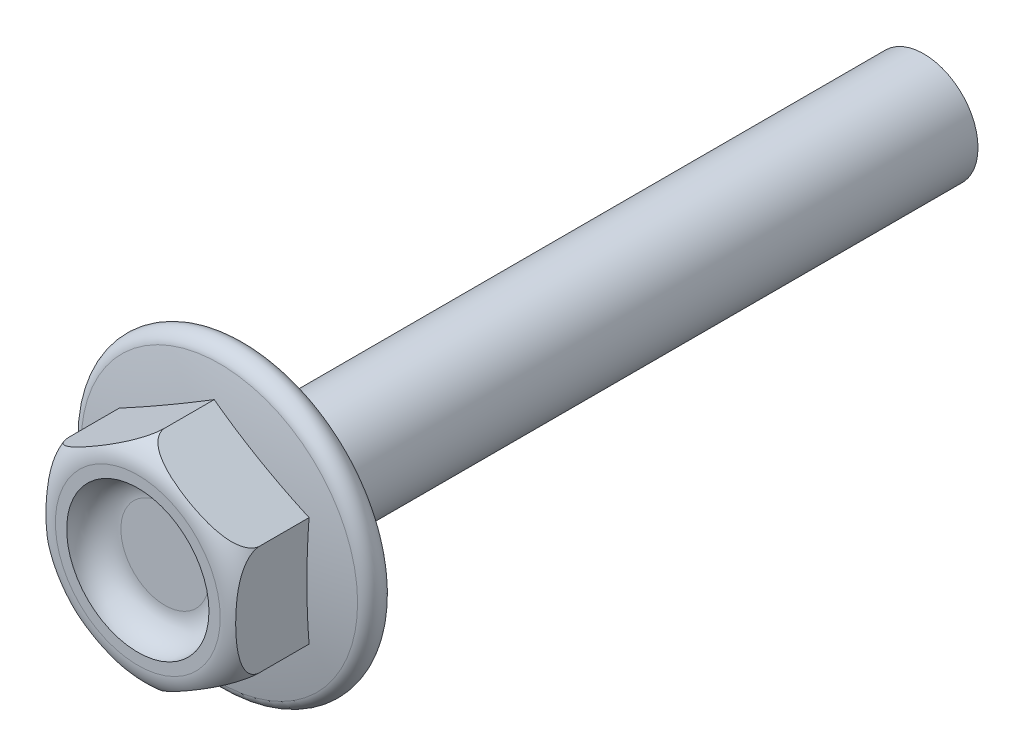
ISO-10303-21;
HEADER;
FILE_DESCRIPTION(('STEP AP214'),'2;1');
FILE_NAME('part.step','',(''),(''),'','','');
FILE_SCHEMA(('AUTOMOTIVE_DESIGN { 1 0 10303 214 1 1 1 1 }'));
ENDSEC;
DATA;
#1=APPLICATION_CONTEXT('core data for automotive mechanical design processes');
#2=APPLICATION_PROTOCOL_DEFINITION('international standard','automotive_design',2000,#1);
#3=PRODUCT_CONTEXT('',#1,'mechanical');
#4=PRODUCT('Part','Part','',(#3));
#5=PRODUCT_RELATED_PRODUCT_CATEGORY('part','',(#4));
#6=PRODUCT_DEFINITION_FORMATION('','',#4);
#7=PRODUCT_DEFINITION_CONTEXT('part definition',#1,'design');
#8=PRODUCT_DEFINITION('design','',#6,#7);
#9=PRODUCT_DEFINITION_SHAPE('','',#8);
#10=(LENGTH_UNIT() NAMED_UNIT(*) SI_UNIT(.MILLI.,.METRE.));
#11=(NAMED_UNIT(*) PLANE_ANGLE_UNIT() SI_UNIT($,.RADIAN.));
#12=(NAMED_UNIT(*) SI_UNIT($,.STERADIAN.) SOLID_ANGLE_UNIT());
#13=UNCERTAINTY_MEASURE_WITH_UNIT(LENGTH_MEASURE(1.E-05),#10,'distance_accuracy_value','');
#14=(GEOMETRIC_REPRESENTATION_CONTEXT(3) GLOBAL_UNCERTAINTY_ASSIGNED_CONTEXT((#13)) GLOBAL_UNIT_ASSIGNED_CONTEXT((#10,
#11,#12)) REPRESENTATION_CONTEXT('',''));
#15=CARTESIAN_POINT('',(0.,0.,0.));
#16=DIRECTION('',(0.,0.,1.));
#17=DIRECTION('',(1.,0.,0.));
#18=AXIS2_PLACEMENT_3D('',#15,#16,#17);
#19=CARTESIAN_POINT('',(0.,4.04145188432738,4.));
#20=DIRECTION('',(0.500000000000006,0.866025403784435,0.));
#21=DIRECTION('',(-0.866025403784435,0.500000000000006,0.));
#22=AXIS2_PLACEMENT_3D('',#19,#20,#21);
#23=PLANE('',#22);
#24=DIRECTION('',(0.,0.,-1.));
#25=VECTOR('',#24,1.);
#26=CARTESIAN_POINT('',(0.,4.04145188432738,4.));
#27=LINE('',#26,#25);
#28=CARTESIAN_POINT('',(0.,4.04145188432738,3.));
#29=VERTEX_POINT('',#28);
#30=CARTESIAN_POINT('',(0.,4.04145188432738,1.18087034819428));
#31=VERTEX_POINT('',#30);
#32=EDGE_CURVE('E51',#29,#31,#27,.T.);
#33=ORIENTED_EDGE('',*,*,#32,.F.);
#34=CARTESIAN_POINT('',(3.46410156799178E-08,4.04145186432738,2.9998));
#35=CARTESIAN_POINT('',(-6.54132162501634E-05,4.04148965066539,3.02946004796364));
#36=CARTESIAN_POINT('',(0.00226144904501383,4.04014623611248,3.05905658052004));
#37=CARTESIAN_POINT('',(0.0112266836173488,4.03497015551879,3.11713737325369));
#38=CARTESIAN_POINT('',(0.0178312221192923,4.03115702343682,3.14562851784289));
#39=CARTESIAN_POINT('',(0.0348712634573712,4.02131895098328,3.20093447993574));
#40=CARTESIAN_POINT('',(0.0452976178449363,4.01529929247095,3.22775312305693));
#41=CARTESIAN_POINT('',(0.0693600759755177,4.0014068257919,3.27943202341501));
#42=CARTESIAN_POINT('',(0.0830027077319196,3.99353024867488,3.30428815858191));
#43=CARTESIAN_POINT('',(0.121428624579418,3.97134503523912,3.36543474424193));
#44=CARTESIAN_POINT('',(0.148119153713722,3.95593525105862,3.40012716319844));
#45=CARTESIAN_POINT('',(0.205872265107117,3.9225914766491,3.46423943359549));
#46=CARTESIAN_POINT('',(0.23694539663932,3.90465139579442,3.49364616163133));
#47=CARTESIAN_POINT('',(0.323036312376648,3.85494678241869,3.5651961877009));
#48=CARTESIAN_POINT('',(0.380554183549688,3.82173882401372,3.60329409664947));
#49=CARTESIAN_POINT('',(0.499668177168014,3.75296832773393,3.66943708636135));
#50=CARTESIAN_POINT('',(0.561272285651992,3.71740117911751,3.69746175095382));
#51=CARTESIAN_POINT('',(0.70657163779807,3.6335125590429,3.75351666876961));
#52=CARTESIAN_POINT('',(0.791067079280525,3.5847290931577,3.77871981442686));
#53=CARTESIAN_POINT('',(0.961803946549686,3.48615411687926,3.81977186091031));
#54=CARTESIAN_POINT('',(1.04804876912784,3.43636064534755,3.83560030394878));
#55=CARTESIAN_POINT('',(1.22192619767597,3.33597246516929,3.8605608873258));
#56=CARTESIAN_POINT('',(1.3095643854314,3.2853745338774,3.86963887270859));
#57=CARTESIAN_POINT('',(1.48502337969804,3.18407323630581,3.88252309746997));
#58=CARTESIAN_POINT('',(1.57284392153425,3.13337002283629,3.88633451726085));
#59=CARTESIAN_POINT('',(1.75592877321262,3.02766593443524,3.88956421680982));
#60=CARTESIAN_POINT('',(1.85119817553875,2.97266211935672,3.88858622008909));
#61=CARTESIAN_POINT('',(2.04168348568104,2.86268537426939,3.88109833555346));
#62=CARTESIAN_POINT('',(2.1368992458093,2.80771252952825,3.87458294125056));
#63=CARTESIAN_POINT('',(2.32594109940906,2.69856916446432,3.85466572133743));
#64=CARTESIAN_POINT('',(2.41977196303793,2.64439589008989,3.84132691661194));
#65=CARTESIAN_POINT('',(2.60599333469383,2.53688093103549,3.80514232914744));
#66=CARTESIAN_POINT('',(2.69838642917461,2.48353775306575,3.78231634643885));
#67=CARTESIAN_POINT('',(2.8368207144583,2.40361268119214,3.73693902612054));
#68=CARTESIAN_POINT('',(2.88407819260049,2.37632856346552,3.71938388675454));
#69=CARTESIAN_POINT('',(2.97718566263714,2.3225729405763,3.67952045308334));
#70=CARTESIAN_POINT('',(3.02303335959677,2.29610276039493,3.65720483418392));
#71=CARTESIAN_POINT('',(3.1126878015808,2.2443407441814,3.60659866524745));
#72=CARTESIAN_POINT('',(3.15647528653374,2.21906002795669,3.57826174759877));
#73=CARTESIAN_POINT('',(3.24002372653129,2.17082331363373,3.5144939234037));
#74=CARTESIAN_POINT('',(3.27979325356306,2.14786236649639,3.47907862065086));
#75=CARTESIAN_POINT('',(3.33931362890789,2.11349826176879,3.4146055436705));
#76=CARTESIAN_POINT('',(3.36104751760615,2.10095019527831,3.38800019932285));
#77=CARTESIAN_POINT('',(3.40092876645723,2.07792474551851,3.33138585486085));
#78=CARTESIAN_POINT('',(3.41907945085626,2.06744544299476,3.30138005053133));
#79=CARTESIAN_POINT('',(3.44834249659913,2.0505504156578,3.24278652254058));
#80=CARTESIAN_POINT('',(3.46009477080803,2.04376523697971,3.21462807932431));
#81=CARTESIAN_POINT('',(3.47936142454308,2.03264162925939,3.15645553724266));
#82=CARTESIAN_POINT('',(3.48688485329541,2.028297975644,3.12644555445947));
#83=CARTESIAN_POINT('',(3.49465097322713,2.02381420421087,3.08009860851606));
#84=CARTESIAN_POINT('',(3.49665509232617,2.02265712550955,3.06413628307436));
#85=CARTESIAN_POINT('',(3.49933449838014,2.02111016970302,3.03205266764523));
#86=CARTESIAN_POINT('',(3.50000884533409,2.02072083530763,3.01593127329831));
#87=CARTESIAN_POINT('',(3.49999996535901,2.02072596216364,2.9998));
#88=B_SPLINE_CURVE_WITH_KNOTS('',3,(#34,#35,#36,#37,#38,#39,#40,#41,#42,#43,#44,#45,#46,#47,#48,
#49,#50,#51,#52,#53,#54,#55,#56,#57,#58,#59,#60,#61,#62,#63,#64,#65,#66,#67,#68,#69,#70,#71,#72,
#73,#74,#75,#76,#77,#78,#79,#80,#81,#82,#83,#84,#85,#86,#87),.UNSPECIFIED.,.F.,.F.,(4,2,2,2,2,2,
2,2,2,2,2,2,2,2,2,2,2,2,2,2,2,2,2,2,2,2,4),(0.,0.0887549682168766,0.176816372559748,
0.264668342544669,0.352700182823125,0.491116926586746,0.629872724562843,0.858271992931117,
1.08713159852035,1.38870326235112,1.69093062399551,1.99555716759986,2.29988385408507,
2.62979570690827,2.96003601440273,3.28727986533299,3.61384415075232,3.78564861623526,
3.95771935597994,4.13116655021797,4.30423552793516,4.41365097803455,4.52296443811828,
4.61636709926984,4.70956912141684,4.75789060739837,4.8062462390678),.UNSPECIFIED.);
#89=CARTESIAN_POINT('',(3.49999999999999,2.0207259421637,3.));
#90=VERTEX_POINT('',#89);
#91=EDGE_CURVE('E44',#29,#90,#88,.T.);
#92=ORIENTED_EDGE('',*,*,#91,.T.);
#93=DIRECTION('',(0.,0.,-1.));
#94=VECTOR('',#93,1.);
#95=CARTESIAN_POINT('',(3.49999999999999,2.02072594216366,4.));
#96=LINE('',#95,#94);
#97=CARTESIAN_POINT('',(3.49999999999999,2.02072594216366,1.18087034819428));
#98=VERTEX_POINT('',#97);
#99=EDGE_CURVE('E92',#90,#98,#96,.T.);
#100=ORIENTED_EDGE('',*,*,#99,.T.);
#101=CARTESIAN_POINT('',(1.75000000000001,3.0310889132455,-24.25));
#102=DIRECTION('',(0.500000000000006,0.866025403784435,0.));
#103=DIRECTION('',(-0.866025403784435,0.500000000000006,0.));
#104=AXIS2_PLACEMENT_3D('',#101,#102,#103);
#105=CIRCLE('',#104,25.5110270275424);
#106=EDGE_CURVE('E111',#98,#31,#105,.F.);
#107=ORIENTED_EDGE('',*,*,#106,.T.);
#108=EDGE_LOOP('',(#33,#92,#100,#107));
#109=FACE_BOUND('',#108,.T.);
#110=ADVANCED_FACE('F28',(#109),#23,.T.);
#111=CARTESIAN_POINT('',(3.49999999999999,2.02072594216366,4.));
#112=DIRECTION('',(1.,0.,0.));
#113=DIRECTION('',(0.,1.,0.));
#114=AXIS2_PLACEMENT_3D('',#111,#112,#113);
#115=PLANE('',#114);
#116=ORIENTED_EDGE('',*,*,#99,.F.);
#117=CARTESIAN_POINT('',(3.49999999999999,0.,3.88866958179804));
#118=CARTESIAN_POINT('',(3.49999999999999,-0.0863268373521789,3.88866475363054));
#119=CARTESIAN_POINT('',(3.49999999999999,-0.172651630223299,3.88703903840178));
#120=CARTESIAN_POINT('',(3.49999999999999,-0.345200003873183,3.88029865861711));
#121=CARTESIAN_POINT('',(3.49999999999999,-0.431423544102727,3.87518289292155));
#122=CARTESIAN_POINT('',(3.49999999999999,-0.603354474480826,3.86079550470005));
#123=CARTESIAN_POINT('',(3.49999999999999,-0.689062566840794,3.85153259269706));
#124=CARTESIAN_POINT('',(3.49999999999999,-0.859711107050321,3.82768385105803));
#125=CARTESIAN_POINT('',(3.49999999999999,-0.944652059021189,3.81310182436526));
#126=CARTESIAN_POINT('',(3.49999999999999,-1.10047939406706,3.77956527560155));
#127=CARTESIAN_POINT('',(3.49999999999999,-1.17157101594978,3.7615884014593));
#128=CARTESIAN_POINT('',(3.49999999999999,-1.31198004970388,3.71895615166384));
#129=CARTESIAN_POINT('',(3.49999999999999,-1.38129291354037,3.69428522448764));
#130=CARTESIAN_POINT('',(3.49999999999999,-1.51730819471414,3.63592514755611));
#131=CARTESIAN_POINT('',(3.49999999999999,-1.58395793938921,3.60210997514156));
#132=CARTESIAN_POINT('',(3.49999999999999,-1.71012924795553,3.52311771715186));
#133=CARTESIAN_POINT('',(3.49999999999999,-1.76969019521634,3.47800819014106));
#134=CARTESIAN_POINT('',(3.49999999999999,-1.84774561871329,3.40145225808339));
#135=CARTESIAN_POINT('',(3.49999999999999,-1.87138500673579,3.3752636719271));
#136=CARTESIAN_POINT('',(3.49999999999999,-1.91465839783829,3.31970869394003));
#137=CARTESIAN_POINT('',(3.49999999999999,-1.93429275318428,3.2903425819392));
#138=CARTESIAN_POINT('',(3.49999999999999,-1.96851600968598,3.228316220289));
#139=CARTESIAN_POINT('',(3.49999999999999,-1.98304564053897,3.19562261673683));
#140=CARTESIAN_POINT('',(3.49999999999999,-2.0054250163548,3.12802070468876));
#141=CARTESIAN_POINT('',(3.49999999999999,-2.01328508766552,3.09311591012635));
#142=CARTESIAN_POINT('',(3.49999999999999,-2.02095945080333,3.02693329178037));
#143=CARTESIAN_POINT('',(3.49999999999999,-2.02166949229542,2.99575843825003));
#144=CARTESIAN_POINT('',(3.49999999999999,-2.01730141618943,2.93381941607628));
#145=CARTESIAN_POINT('',(3.49999999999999,-2.01222343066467,2.90305523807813));
#146=CARTESIAN_POINT('',(3.49999999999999,-1.99739983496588,2.84550196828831));
#147=CARTESIAN_POINT('',(3.49999999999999,-1.98808984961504,2.81859776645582));
#148=CARTESIAN_POINT('',(3.49999999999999,-1.96561338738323,2.76647205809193));
#149=CARTESIAN_POINT('',(3.49999999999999,-1.95244609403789,2.74125090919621));
#150=CARTESIAN_POINT('',(3.49999999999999,-1.91585963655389,2.68119414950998));
#151=CARTESIAN_POINT('',(3.49999999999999,-1.89054654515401,2.64751269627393));
#152=CARTESIAN_POINT('',(3.49999999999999,-1.83488053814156,2.58459756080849));
#153=CARTESIAN_POINT('',(3.49999999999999,-1.80451416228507,2.55537616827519));
#154=CARTESIAN_POINT('',(3.49999999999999,-1.72189631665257,2.48560726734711));
#155=CARTESIAN_POINT('',(3.49999999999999,-1.66706197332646,2.4481420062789));
#156=CARTESIAN_POINT('',(3.49999999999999,-1.55256598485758,2.38180725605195));
#157=CARTESIAN_POINT('',(3.49999999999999,-1.49289865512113,2.35294808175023));
#158=CARTESIAN_POINT('',(3.49999999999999,-1.3721212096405,2.30262557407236));
#159=CARTESIAN_POINT('',(3.49999999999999,-1.31107157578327,2.28101370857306));
#160=CARTESIAN_POINT('',(3.49999999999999,-1.18734677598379,2.24298388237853));
#161=CARTESIAN_POINT('',(3.49999999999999,-1.12466994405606,2.22657149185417));
#162=CARTESIAN_POINT('',(3.49999999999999,-0.997959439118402,2.19781531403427));
#163=CARTESIAN_POINT('',(3.49999999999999,-0.933919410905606,2.18550018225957));
#164=CARTESIAN_POINT('',(3.49999999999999,-0.805330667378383,2.16427101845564));
#165=CARTESIAN_POINT('',(3.49999999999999,-0.740782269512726,2.15535501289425));
#166=CARTESIAN_POINT('',(3.49999999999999,-0.598058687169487,2.13873267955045));
#167=CARTESIAN_POINT('',(3.49999999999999,-0.519811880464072,2.13165251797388));
#168=CARTESIAN_POINT('',(3.49999999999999,-0.36308132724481,2.12073868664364));
#169=CARTESIAN_POINT('',(3.49999999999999,-0.284597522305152,2.11690589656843));
#170=CARTESIAN_POINT('',(3.49999999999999,-0.127339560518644,2.11205625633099));
#171=CARTESIAN_POINT('',(3.49999999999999,-0.0485651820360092,2.11104681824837));
#172=CARTESIAN_POINT('',(3.49999999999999,0.108959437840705,2.11174847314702));
#173=CARTESIAN_POINT('',(3.49999999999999,0.18770968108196,2.11345913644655));
#174=CARTESIAN_POINT('',(3.49999999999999,0.344482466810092,2.11977175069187));
#175=CARTESIAN_POINT('',(3.49999999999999,0.42250589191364,2.12435103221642));
#176=CARTESIAN_POINT('',(3.49999999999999,0.578320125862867,2.13688479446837));
#177=CARTESIAN_POINT('',(3.49999999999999,0.656110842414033,2.14484047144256));
#178=CARTESIAN_POINT('',(3.49999999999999,0.810862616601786,2.1649235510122));
#179=CARTESIAN_POINT('',(3.49999999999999,0.887825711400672,2.17703484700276));
#180=CARTESIAN_POINT('',(3.49999999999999,1.04069181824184,2.20662161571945));
#181=CARTESIAN_POINT('',(3.49999999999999,1.11659576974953,2.22409197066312));
#182=CARTESIAN_POINT('',(3.49999999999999,1.22622138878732,2.25478752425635));
#183=CARTESIAN_POINT('',(3.49999999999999,1.26071408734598,2.26525722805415));
#184=CARTESIAN_POINT('',(3.49999999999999,1.32913620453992,2.28791589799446));
#185=CARTESIAN_POINT('',(3.49999999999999,1.36306544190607,2.30010540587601));
#186=CARTESIAN_POINT('',(3.49999999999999,1.46365216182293,2.33955916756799));
#187=CARTESIAN_POINT('',(3.49999999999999,1.52924178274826,2.369743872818));
#188=CARTESIAN_POINT('',(3.49999999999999,1.63826125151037,2.43070580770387));
#189=CARTESIAN_POINT('',(3.49999999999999,1.68295511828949,2.45920328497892));
#190=CARTESIAN_POINT('',(3.49999999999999,1.76768051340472,2.52254240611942));
#191=CARTESIAN_POINT('',(3.49999999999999,1.8077188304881,2.55737461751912));
#192=CARTESIAN_POINT('',(3.49999999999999,1.86880478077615,2.62179662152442));
#193=CARTESIAN_POINT('',(3.49999999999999,1.89183062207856,2.64950003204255));
#194=CARTESIAN_POINT('',(3.49999999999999,1.93330435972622,2.70815552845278));
#195=CARTESIAN_POINT('',(3.49999999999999,1.95175915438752,2.73910261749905));
#196=CARTESIAN_POINT('',(3.49999999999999,1.98020381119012,2.79847583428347));
#197=CARTESIAN_POINT('',(3.49999999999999,1.99108975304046,2.8264695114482));
#198=CARTESIAN_POINT('',(3.49999999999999,2.00802811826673,2.88389269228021));
#199=CARTESIAN_POINT('',(3.49999999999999,2.01408338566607,2.91332134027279));
#200=CARTESIAN_POINT('',(3.49999999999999,2.02088735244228,2.9729068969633));
#201=CARTESIAN_POINT('',(3.49999999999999,2.02161631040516,3.00306609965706));
#202=CARTESIAN_POINT('',(3.49999999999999,2.01765062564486,3.06302342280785));
#203=CARTESIAN_POINT('',(3.49999999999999,2.01295539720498,3.09282150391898));
#204=CARTESIAN_POINT('',(3.49999999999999,1.99894363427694,3.14951865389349));
#205=CARTESIAN_POINT('',(3.49999999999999,1.98990016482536,3.17648665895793));
#206=CARTESIAN_POINT('',(3.49999999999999,1.96792176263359,3.22877122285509));
#207=CARTESIAN_POINT('',(3.49999999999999,1.95498534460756,3.25408714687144));
#208=CARTESIAN_POINT('',(3.49999999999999,1.91910314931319,3.31410022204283));
#209=CARTESIAN_POINT('',(3.49999999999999,1.89430007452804,3.34768656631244));
#210=CARTESIAN_POINT('',(3.49999999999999,1.83966536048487,3.41047531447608));
#211=CARTESIAN_POINT('',(3.49999999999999,1.80982214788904,3.43966732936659));
#212=CARTESIAN_POINT('',(3.49999999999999,1.72878496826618,3.50921588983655));
#213=CARTESIAN_POINT('',(3.49999999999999,1.67504338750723,3.54658123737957));
#214=CARTESIAN_POINT('',(3.49999999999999,1.56265233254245,3.61290679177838));
#215=CARTESIAN_POINT('',(3.49999999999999,1.50399107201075,3.64184602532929));
#216=CARTESIAN_POINT('',(3.49999999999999,1.38547326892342,3.69227368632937));
#217=CARTESIAN_POINT('',(3.49999999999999,1.32569142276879,3.71394172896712));
#218=CARTESIAN_POINT('',(3.49999999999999,1.20448970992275,3.75217091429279));
#219=CARTESIAN_POINT('',(3.49999999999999,1.14306820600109,3.76872672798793));
#220=CARTESIAN_POINT('',(3.49999999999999,1.01920506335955,3.79774633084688));
#221=CARTESIAN_POINT('',(3.49999999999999,0.956762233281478,3.81020492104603));
#222=CARTESIAN_POINT('',(3.49999999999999,0.83129623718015,3.83179537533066));
#223=CARTESIAN_POINT('',(3.49999999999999,0.768272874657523,3.84092606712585));
#224=CARTESIAN_POINT('',(3.49999999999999,0.588181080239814,3.86310397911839));
#225=CARTESIAN_POINT('',(3.49999999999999,0.470713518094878,3.8728822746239));
#226=CARTESIAN_POINT('',(3.49999999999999,0.235495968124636,3.88566728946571));
#227=CARTESIAN_POINT('',(3.49999999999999,0.117746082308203,3.88867616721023));
#228=CARTESIAN_POINT('',(3.49999999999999,0.,3.88866958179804));
#229=B_SPLINE_CURVE_WITH_KNOTS('',3,(#117,#118,#119,#120,#121,#122,#123,#124,#125,#126,#127,
#128,#129,#130,#131,#132,#133,#134,#135,#136,#137,#138,#139,#140,#141,#142,#143,#144,#145,#146,
#147,#148,#149,#150,#151,#152,#153,#154,#155,#156,#157,#158,#159,#160,#161,#162,#163,#164,#165,
#166,#167,#168,#169,#170,#171,#172,#173,#174,#175,#176,#177,#178,#179,#180,#181,#182,#183,#184,
#185,#186,#187,#188,#189,#190,#191,#192,#193,#194,#195,#196,#197,#198,#199,#200,#201,#202,#203,
#204,#205,#206,#207,#208,#209,#210,#211,#212,#213,#214,#215,#216,#217,#218,#219,#220,#221,#222,
#223,#224,#225,#226,#227,#228),.UNSPECIFIED.,.T.,.F.,(4,2,2,2,2,2,2,2,2,2,2,2,2,2,2,2,2,2,2,2,2,
2,2,2,2,2,2,2,2,2,2,2,2,2,2,2,2,2,2,2,2,2,2,2,2,2,2,2,2,2,2,2,2,2,2,4),(0.,0.258960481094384,
0.518002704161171,0.776503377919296,1.03481959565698,1.25457530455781,1.47484598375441,
1.69832240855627,1.92049274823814,2.02603918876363,2.13157634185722,2.23830124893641,
2.34486061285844,2.43787441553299,2.53088609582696,2.61595499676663,2.7010419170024,
2.82672538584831,2.95274915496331,3.15085859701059,3.34920453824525,3.54319361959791,
3.73738982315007,3.93291697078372,4.12833042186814,4.36394350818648,4.59962039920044,
4.83591542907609,5.07217313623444,5.30658695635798,5.5410838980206,5.77468204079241,
6.0080577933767,6.11615522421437,6.22428678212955,6.44013860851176,6.59875051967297,
6.75712816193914,6.86485155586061,6.9724113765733,7.06214192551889,7.15181960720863,
7.24182950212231,7.33184911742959,7.4168355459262,7.50185444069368,7.62640196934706,
7.75123947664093,7.94649755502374,8.14223757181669,8.33270789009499,8.52337608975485,
8.71428530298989,8.9052617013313,9.25858529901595,9.61179622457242),.UNSPECIFIED.);
#230=CARTESIAN_POINT('',(3.49999999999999,-2.0207259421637,3.));
#231=VERTEX_POINT('',#230);
#232=EDGE_CURVE('E81',#90,#231,#229,.T.);
#233=ORIENTED_EDGE('',*,*,#232,.T.);
#234=DIRECTION('',(0.,0.,-1.));
#235=VECTOR('',#234,1.);
#236=CARTESIAN_POINT('',(3.49999999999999,-2.0207259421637,4.));
#237=LINE('',#236,#235);
#238=CARTESIAN_POINT('',(3.49999999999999,-2.0207259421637,1.18087034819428));
#239=VERTEX_POINT('',#238);
#240=EDGE_CURVE('E100',#231,#239,#237,.T.);
#241=ORIENTED_EDGE('',*,*,#240,.T.);
#242=CARTESIAN_POINT('',(3.49999999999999,0.,-24.25));
#243=DIRECTION('',(1.,0.,0.));
#244=DIRECTION('',(0.,1.,0.));
#245=AXIS2_PLACEMENT_3D('',#242,#243,#244);
#246=CIRCLE('',#245,25.5110270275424);
#247=EDGE_CURVE('E99',#239,#98,#246,.F.);
#248=ORIENTED_EDGE('',*,*,#247,.T.);
#249=EDGE_LOOP('',(#116,#233,#241,#248));
#250=FACE_BOUND('',#249,.T.);
#251=ADVANCED_FACE('F97',(#250),#115,.T.);
#252=CARTESIAN_POINT('',(3.49999999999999,-2.0207259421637,4.));
#253=DIRECTION('',(0.499999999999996,-0.866025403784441,0.));
#254=DIRECTION('',(0.866025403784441,0.499999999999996,0.));
#255=AXIS2_PLACEMENT_3D('',#252,#253,#254);
#256=PLANE('',#255);
#257=ORIENTED_EDGE('',*,*,#240,.F.);
#258=CARTESIAN_POINT('',(3.49999996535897,-2.0207259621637,2.9998));
#259=CARTESIAN_POINT('',(3.50006541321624,-2.02068817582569,3.02946004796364));
#260=CARTESIAN_POINT('',(3.49773855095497,-2.0220315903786,3.05905658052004));
#261=CARTESIAN_POINT('',(3.48877331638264,-2.02720767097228,3.11713737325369));
#262=CARTESIAN_POINT('',(3.48216877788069,-2.03102080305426,3.14562851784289));
#263=CARTESIAN_POINT('',(3.46512873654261,-2.0408588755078,3.20093447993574));
#264=CARTESIAN_POINT('',(3.45470238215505,-2.04687853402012,3.22775312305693));
#265=CARTESIAN_POINT('',(3.43063992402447,-2.06077100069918,3.27943202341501));
#266=CARTESIAN_POINT('',(3.41699729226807,-2.06864757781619,3.3042881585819));
#267=CARTESIAN_POINT('',(3.37857137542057,-2.09083279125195,3.36543474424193));
#268=CARTESIAN_POINT('',(3.35188084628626,-2.10624257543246,3.40012716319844));
#269=CARTESIAN_POINT('',(3.29412773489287,-2.13958634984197,3.46423943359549));
#270=CARTESIAN_POINT('',(3.26305460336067,-2.15752643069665,3.49364616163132));
#271=CARTESIAN_POINT('',(3.17696368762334,-2.20723104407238,3.56519618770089));
#272=CARTESIAN_POINT('',(3.1194458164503,-2.24043900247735,3.60329409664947));
#273=CARTESIAN_POINT('',(3.00033182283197,-2.30920949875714,3.66943708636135));
#274=CARTESIAN_POINT('',(2.93872771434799,-2.34477664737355,3.69746175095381));
#275=CARTESIAN_POINT('',(2.79342836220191,-2.42866526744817,3.75351666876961));
#276=CARTESIAN_POINT('',(2.70893292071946,-2.47744873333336,3.77871981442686));
#277=CARTESIAN_POINT('',(2.5381960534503,-2.5760237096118,3.8197718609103));
#278=CARTESIAN_POINT('',(2.45195123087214,-2.62581718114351,3.83560030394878));
#279=CARTESIAN_POINT('',(2.27807380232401,-2.72620536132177,3.86056088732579));
#280=CARTESIAN_POINT('',(2.19043561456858,-2.77680329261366,3.86963887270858));
#281=CARTESIAN_POINT('',(2.01497662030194,-2.87810459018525,3.88252309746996));
#282=CARTESIAN_POINT('',(1.92715607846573,-2.92880780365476,3.88633451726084));
#283=CARTESIAN_POINT('',(1.74407122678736,-3.03451189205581,3.88956421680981));
#284=CARTESIAN_POINT('',(1.64880182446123,-3.08951570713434,3.88858622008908));
#285=CARTESIAN_POINT('',(1.45831651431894,-3.19949245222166,3.88109833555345));
#286=CARTESIAN_POINT('',(1.36310075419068,-3.2544652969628,3.87458294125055));
#287=CARTESIAN_POINT('',(1.17405890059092,-3.36360866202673,3.85466572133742));
#288=CARTESIAN_POINT('',(1.08022803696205,-3.41778193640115,3.84132691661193));
#289=CARTESIAN_POINT('',(0.894006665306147,-3.52529689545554,3.80514232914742));
#290=CARTESIAN_POINT('',(0.801613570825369,-3.57864007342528,3.78231634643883));
#291=CARTESIAN_POINT('',(0.663179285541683,-3.65856514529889,3.73693902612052));
#292=CARTESIAN_POINT('',(0.615921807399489,-3.68584926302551,3.71938388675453));
#293=CARTESIAN_POINT('',(0.522814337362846,-3.73960488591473,3.67952045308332));
#294=CARTESIAN_POINT('',(0.476966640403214,-3.7660750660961,3.65720483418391));
#295=CARTESIAN_POINT('',(0.387312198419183,-3.81783708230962,3.60659866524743));
#296=CARTESIAN_POINT('',(0.34352471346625,-3.84311779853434,3.57826174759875));
#297=CARTESIAN_POINT('',(0.259976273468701,-3.89135451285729,3.51449392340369));
#298=CARTESIAN_POINT('',(0.22020674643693,-3.91431545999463,3.47907862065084));
#299=CARTESIAN_POINT('',(0.160686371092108,-3.94867956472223,3.41460554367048));
#300=CARTESIAN_POINT('',(0.138952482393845,-3.96122763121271,3.38800019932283));
#301=CARTESIAN_POINT('',(0.0990712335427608,-3.9842530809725,3.33138585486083));
#302=CARTESIAN_POINT('',(0.0809205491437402,-3.99473238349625,3.30138005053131));
#303=CARTESIAN_POINT('',(0.0516575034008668,-4.01162741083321,3.24278652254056));
#304=CARTESIAN_POINT('',(0.0399052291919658,-4.01841258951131,3.21462807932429));
#305=CARTESIAN_POINT('',(0.0206385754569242,-4.02953619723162,3.15645553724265));
#306=CARTESIAN_POINT('',(0.0131151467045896,-4.03387985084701,3.12644555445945));
#307=CARTESIAN_POINT('',(0.0053490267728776,-4.03836362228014,3.08009860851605));
#308=CARTESIAN_POINT('',(0.00334490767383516,-4.03952070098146,3.06413628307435));
#309=CARTESIAN_POINT('',(0.00066550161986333,-4.04106765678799,3.03205266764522));
#310=CARTESIAN_POINT('',(-8.84533408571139E-06,-4.04145699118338,3.01593127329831));
#311=CARTESIAN_POINT('',(3.46409954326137E-08,-4.04145186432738,2.9998));
#312=B_SPLINE_CURVE_WITH_KNOTS('',3,(#258,#259,#260,#261,#262,#263,#264,#265,#266,#267,#268,
#269,#270,#271,#272,#273,#274,#275,#276,#277,#278,#279,#280,#281,#282,#283,#284,#285,#286,#287,
#288,#289,#290,#291,#292,#293,#294,#295,#296,#297,#298,#299,#300,#301,#302,#303,#304,#305,#306,
#307,#308,#309,#310,#311),.UNSPECIFIED.,.F.,.F.,(4,2,2,2,2,2,2,2,2,2,2,2,2,2,2,2,2,2,2,2,2,2,2,
2,2,2,4),(0.,0.088754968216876,0.176816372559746,0.264668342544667,0.352700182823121,
0.491116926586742,0.629872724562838,0.858271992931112,1.08713159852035,1.38870326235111,
1.69093062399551,1.99555716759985,2.29988385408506,2.62979570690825,2.96003601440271,
3.28727986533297,3.6138441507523,3.78564861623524,3.95771935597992,4.13116655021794,
4.30423552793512,4.41365097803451,4.52296443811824,4.61636709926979,4.70956912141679,
4.75789060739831,4.80624623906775),.UNSPECIFIED.);
#313=CARTESIAN_POINT('',(0.,-4.04145188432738,3.));
#314=VERTEX_POINT('',#313);
#315=EDGE_CURVE('E85',#231,#314,#312,.T.);
#316=ORIENTED_EDGE('',*,*,#315,.T.);
#317=DIRECTION('',(0.,0.,-1.));
#318=VECTOR('',#317,1.);
#319=CARTESIAN_POINT('',(0.,-4.04145188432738,4.));
#320=LINE('',#319,#318);
#321=CARTESIAN_POINT('',(0.,-4.04145188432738,1.18087034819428));
#322=VERTEX_POINT('',#321);
#323=EDGE_CURVE('E102',#314,#322,#320,.T.);
#324=ORIENTED_EDGE('',*,*,#323,.T.);
#325=CARTESIAN_POINT('',(1.74999999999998,-3.03108891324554,-24.25));
#326=DIRECTION('',(0.499999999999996,-0.866025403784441,0.));
#327=DIRECTION('',(0.866025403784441,0.499999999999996,0.));
#328=AXIS2_PLACEMENT_3D('',#325,#326,#327);
#329=CIRCLE('',#328,25.5110270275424);
#330=EDGE_CURVE('E256',#322,#239,#329,.F.);
#331=ORIENTED_EDGE('',*,*,#330,.T.);
#332=EDGE_LOOP('',(#257,#316,#324,#331));
#333=FACE_BOUND('',#332,.T.);
#334=ADVANCED_FACE('F157',(#333),#256,.T.);
#335=CARTESIAN_POINT('',(0.,-4.04145188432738,4.));
#336=DIRECTION('',(-0.499999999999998,-0.86602540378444,0.));
#337=DIRECTION('',(0.86602540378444,-0.499999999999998,0.));
#338=AXIS2_PLACEMENT_3D('',#335,#336,#337);
#339=PLANE('',#338);
#340=ORIENTED_EDGE('',*,*,#323,.F.);
#341=CARTESIAN_POINT('',(-3.4641037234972E-08,-4.04145186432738,2.9998));
#342=CARTESIAN_POINT('',(6.54132162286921E-05,-4.04148965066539,3.02946004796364));
#343=CARTESIAN_POINT('',(-0.00226144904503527,-4.04014623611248,3.05905658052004));
#344=CARTESIAN_POINT('',(-0.01122668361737,-4.03497015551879,3.11713737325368));
#345=CARTESIAN_POINT('',(-0.0178312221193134,-4.03115702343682,3.14562851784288));
#346=CARTESIAN_POINT('',(-0.0348712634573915,-4.02131895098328,3.20093447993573));
#347=CARTESIAN_POINT('',(-0.045297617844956,-4.01529929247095,3.22775312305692));
#348=CARTESIAN_POINT('',(-0.0693600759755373,-4.0014068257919,3.279432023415));
#349=CARTESIAN_POINT('',(-0.0830027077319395,-3.99353024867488,3.3042881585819));
#350=CARTESIAN_POINT('',(-0.121428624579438,-3.97134503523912,3.36543474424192));
#351=CARTESIAN_POINT('',(-0.148119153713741,-3.95593525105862,3.40012716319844));
#352=CARTESIAN_POINT('',(-0.205872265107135,-3.92259147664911,3.46423943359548));
#353=CARTESIAN_POINT('',(-0.236945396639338,-3.90465139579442,3.49364616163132));
#354=CARTESIAN_POINT('',(-0.323036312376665,-3.8549467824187,3.56519618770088));
#355=CARTESIAN_POINT('',(-0.380554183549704,-3.82173882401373,3.60329409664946));
#356=CARTESIAN_POINT('',(-0.499668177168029,-3.75296832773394,3.66943708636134));
#357=CARTESIAN_POINT('',(-0.561272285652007,-3.71740117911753,3.6974617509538));
#358=CARTESIAN_POINT('',(-0.706571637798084,-3.63351255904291,3.7535166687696));
#359=CARTESIAN_POINT('',(-0.791067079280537,-3.58472909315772,3.77871981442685));
#360=CARTESIAN_POINT('',(-0.961803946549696,-3.48615411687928,3.81977186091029));
#361=CARTESIAN_POINT('',(-1.04804876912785,-3.43636064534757,3.83560030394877));
#362=CARTESIAN_POINT('',(-1.22192619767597,-3.33597246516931,3.86056088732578));
#363=CARTESIAN_POINT('',(-1.3095643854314,-3.28537453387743,3.86963887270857));
#364=CARTESIAN_POINT('',(-1.48502337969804,-3.18407323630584,3.88252309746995));
#365=CARTESIAN_POINT('',(-1.57284392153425,-3.13337002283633,3.88633451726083));
#366=CARTESIAN_POINT('',(-1.75592877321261,-3.02766593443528,3.88956421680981));
#367=CARTESIAN_POINT('',(-1.85119817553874,-2.97266211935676,3.88858622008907));
#368=CARTESIAN_POINT('',(-2.04168348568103,-2.86268537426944,3.88109833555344));
#369=CARTESIAN_POINT('',(-2.13689924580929,-2.8077125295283,3.87458294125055));
#370=CARTESIAN_POINT('',(-2.32594109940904,-2.69856916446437,3.85466572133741));
#371=CARTESIAN_POINT('',(-2.41977196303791,-2.64439589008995,3.84132691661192));
#372=CARTESIAN_POINT('',(-2.60599333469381,-2.53688093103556,3.80514232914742));
#373=CARTESIAN_POINT('',(-2.69838642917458,-2.48353775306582,3.78231634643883));
#374=CARTESIAN_POINT('',(-2.83682071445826,-2.40361268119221,3.73693902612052));
#375=CARTESIAN_POINT('',(-2.88407819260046,-2.37632856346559,3.71938388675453));
#376=CARTESIAN_POINT('',(-2.9771856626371,-2.32257294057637,3.67952045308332));
#377=CARTESIAN_POINT('',(-3.02303335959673,-2.29610276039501,3.6572048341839));
#378=CARTESIAN_POINT('',(-3.11268780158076,-2.24434074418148,3.60659866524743));
#379=CARTESIAN_POINT('',(-3.1564752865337,-2.21906002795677,3.57826174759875));
#380=CARTESIAN_POINT('',(-3.24002372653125,-2.17082331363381,3.51449392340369));
#381=CARTESIAN_POINT('',(-3.27979325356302,-2.14786236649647,3.47907862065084));
#382=CARTESIAN_POINT('',(-3.33931362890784,-2.11349826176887,3.41460554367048));
#383=CARTESIAN_POINT('',(-3.3610475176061,-2.10095019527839,3.38800019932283));
#384=CARTESIAN_POINT('',(-3.40092876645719,-2.0779247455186,3.33138585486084));
#385=CARTESIAN_POINT('',(-3.41907945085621,-2.06744544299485,3.30138005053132));
#386=CARTESIAN_POINT('',(-3.44834249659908,-2.05055041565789,3.24278652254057));
#387=CARTESIAN_POINT('',(-3.46009477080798,-2.04376523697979,3.2146280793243));
#388=CARTESIAN_POINT('',(-3.47936142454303,-2.03264162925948,3.15645553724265));
#389=CARTESIAN_POINT('',(-3.48688485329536,-2.02829797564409,3.12644555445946));
#390=CARTESIAN_POINT('',(-3.49465097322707,-2.02381420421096,3.08009860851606));
#391=CARTESIAN_POINT('',(-3.49665509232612,-2.02265712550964,3.06413628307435));
#392=CARTESIAN_POINT('',(-3.49933449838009,-2.02111016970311,3.03205266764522));
#393=CARTESIAN_POINT('',(-3.50000884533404,-2.02072083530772,3.01593127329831));
#394=CARTESIAN_POINT('',(-3.49999996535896,-2.02072596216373,2.9998));
#395=B_SPLINE_CURVE_WITH_KNOTS('',3,(#341,#342,#343,#344,#345,#346,#347,#348,#349,#350,#351,
#352,#353,#354,#355,#356,#357,#358,#359,#360,#361,#362,#363,#364,#365,#366,#367,#368,#369,#370,
#371,#372,#373,#374,#375,#376,#377,#378,#379,#380,#381,#382,#383,#384,#385,#386,#387,#388,#389,
#390,#391,#392,#393,#394),.UNSPECIFIED.,.F.,.F.,(4,2,2,2,2,2,2,2,2,2,2,2,2,2,2,2,2,2,2,2,2,2,2,
2,2,2,4),(0.,0.0887549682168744,0.176816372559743,0.264668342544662,0.352700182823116,
0.491116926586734,0.629872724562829,0.858271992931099,1.08713159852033,1.38870326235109,
1.69093062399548,1.99555716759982,2.29988385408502,2.62979570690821,2.96003601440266,
3.28727986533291,3.61384415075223,3.78564861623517,3.95771935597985,4.13116655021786,
4.30423552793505,4.41365097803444,4.52296443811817,4.61636709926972,4.70956912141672,
4.75789060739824,4.80624623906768),.UNSPECIFIED.);
#396=CARTESIAN_POINT('',(-3.50000000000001,-2.02072594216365,3.));
#397=VERTEX_POINT('',#396);
#398=EDGE_CURVE('E138',#314,#397,#395,.T.);
#399=ORIENTED_EDGE('',*,*,#398,.T.);
#400=DIRECTION('',(0.,0.,-1.));
#401=VECTOR('',#400,1.);
#402=CARTESIAN_POINT('',(-3.50000000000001,-2.0207259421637,4.));
#403=LINE('',#402,#401);
#404=CARTESIAN_POINT('',(-3.50000000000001,-2.0207259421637,1.18087034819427));
#405=VERTEX_POINT('',#404);
#406=EDGE_CURVE('E244',#397,#405,#403,.T.);
#407=ORIENTED_EDGE('',*,*,#406,.T.);
#408=CARTESIAN_POINT('',(-1.75,-3.03108891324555,-24.25));
#409=DIRECTION('',(-0.499999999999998,-0.86602540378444,0.));
#410=DIRECTION('',(0.86602540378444,-0.499999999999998,0.));
#411=AXIS2_PLACEMENT_3D('',#408,#409,#410);
#412=CIRCLE('',#411,25.5110270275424);
#413=EDGE_CURVE('E243',#405,#322,#412,.F.);
#414=ORIENTED_EDGE('',*,*,#413,.T.);
#415=EDGE_LOOP('',(#340,#399,#407,#414));
#416=FACE_BOUND('',#415,.T.);
#417=ADVANCED_FACE('F178',(#416),#339,.T.);
#418=CARTESIAN_POINT('',(-3.50000000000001,-2.0207259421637,4.));
#419=DIRECTION('',(-1.,0.,0.));
#420=DIRECTION('',(0.,-1.,0.));
#421=AXIS2_PLACEMENT_3D('',#418,#419,#420);
#422=PLANE('',#421);
#423=ORIENTED_EDGE('',*,*,#406,.F.);
#424=CARTESIAN_POINT('',(-3.50000000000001,0.,3.88866958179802));
#425=CARTESIAN_POINT('',(-3.50000000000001,0.086326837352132,3.88866475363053));
#426=CARTESIAN_POINT('',(-3.50000000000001,0.172651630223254,3.88703903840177));
#427=CARTESIAN_POINT('',(-3.50000000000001,0.345200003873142,3.8802986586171));
#428=CARTESIAN_POINT('',(-3.50000000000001,0.431423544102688,3.87518289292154));
#429=CARTESIAN_POINT('',(-3.50000000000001,0.603354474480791,3.86079550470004));
#430=CARTESIAN_POINT('',(-3.50000000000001,0.689062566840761,3.85153259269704));
#431=CARTESIAN_POINT('',(-3.50000000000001,0.859711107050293,3.82768385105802));
#432=CARTESIAN_POINT('',(-3.50000000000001,0.944652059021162,3.81310182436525));
#433=CARTESIAN_POINT('',(-3.50000000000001,1.10047939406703,3.77956527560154));
#434=CARTESIAN_POINT('',(-3.50000000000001,1.17157101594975,3.76158840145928));
#435=CARTESIAN_POINT('',(-3.50000000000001,1.31198004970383,3.71895615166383));
#436=CARTESIAN_POINT('',(-3.50000000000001,1.38129291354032,3.69428522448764));
#437=CARTESIAN_POINT('',(-3.50000000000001,1.51730819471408,3.63592514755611));
#438=CARTESIAN_POINT('',(-3.50000000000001,1.58395793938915,3.60210997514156));
#439=CARTESIAN_POINT('',(-3.50000000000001,1.71012924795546,3.52311771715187));
#440=CARTESIAN_POINT('',(-3.50000000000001,1.76969019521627,3.47800819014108));
#441=CARTESIAN_POINT('',(-3.50000000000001,1.84774561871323,3.40145225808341));
#442=CARTESIAN_POINT('',(-3.50000000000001,1.87138500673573,3.37526367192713));
#443=CARTESIAN_POINT('',(-3.50000000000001,1.91465839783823,3.31970869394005));
#444=CARTESIAN_POINT('',(-3.50000000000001,1.93429275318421,3.29034258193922));
#445=CARTESIAN_POINT('',(-3.50000000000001,1.96851600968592,3.22831622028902));
#446=CARTESIAN_POINT('',(-3.50000000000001,1.98304564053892,3.19562261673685));
#447=CARTESIAN_POINT('',(-3.50000000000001,2.00542501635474,3.12802070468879));
#448=CARTESIAN_POINT('',(-3.50000000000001,2.01328508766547,3.09311591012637));
#449=CARTESIAN_POINT('',(-3.50000000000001,2.02095945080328,3.02693329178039));
#450=CARTESIAN_POINT('',(-3.50000000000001,2.02166949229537,2.99575843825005));
#451=CARTESIAN_POINT('',(-3.50000000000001,2.01730141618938,2.9338194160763));
#452=CARTESIAN_POINT('',(-3.50000000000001,2.01222343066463,2.90305523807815));
#453=CARTESIAN_POINT('',(-3.50000000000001,1.99739983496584,2.84550196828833));
#454=CARTESIAN_POINT('',(-3.50000000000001,1.988089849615,2.81859776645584));
#455=CARTESIAN_POINT('',(-3.50000000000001,1.9656133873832,2.76647205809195));
#456=CARTESIAN_POINT('',(-3.50000000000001,1.95244609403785,2.74125090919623));
#457=CARTESIAN_POINT('',(-3.50000000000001,1.91585963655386,2.68119414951));
#458=CARTESIAN_POINT('',(-3.50000000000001,1.89054654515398,2.64751269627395));
#459=CARTESIAN_POINT('',(-3.50000000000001,1.83488053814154,2.58459756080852));
#460=CARTESIAN_POINT('',(-3.50000000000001,1.80451416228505,2.55537616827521));
#461=CARTESIAN_POINT('',(-3.50000000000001,1.72189631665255,2.48560726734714));
#462=CARTESIAN_POINT('',(-3.50000000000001,1.66706197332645,2.44814200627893));
#463=CARTESIAN_POINT('',(-3.50000000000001,1.55256598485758,2.38180725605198));
#464=CARTESIAN_POINT('',(-3.50000000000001,1.49289865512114,2.35294808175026));
#465=CARTESIAN_POINT('',(-3.50000000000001,1.37212120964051,2.30262557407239));
#466=CARTESIAN_POINT('',(-3.50000000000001,1.31107157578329,2.28101370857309));
#467=CARTESIAN_POINT('',(-3.50000000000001,1.18734677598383,2.24298388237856));
#468=CARTESIAN_POINT('',(-3.50000000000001,1.1246699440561,2.2265714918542));
#469=CARTESIAN_POINT('',(-3.50000000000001,0.997959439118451,2.1978153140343));
#470=CARTESIAN_POINT('',(-3.50000000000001,0.93391941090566,2.1855001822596));
#471=CARTESIAN_POINT('',(-3.50000000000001,0.805330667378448,2.16427101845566));
#472=CARTESIAN_POINT('',(-3.50000000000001,0.740782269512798,2.15535501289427));
#473=CARTESIAN_POINT('',(-3.50000000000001,0.598058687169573,2.13873267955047));
#474=CARTESIAN_POINT('',(-3.50000000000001,0.519811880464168,2.1316525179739));
#475=CARTESIAN_POINT('',(-3.50000000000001,0.363081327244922,2.12073868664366));
#476=CARTESIAN_POINT('',(-3.50000000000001,0.284597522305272,2.11690589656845));
#477=CARTESIAN_POINT('',(-3.50000000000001,0.127339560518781,2.11205625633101));
#478=CARTESIAN_POINT('',(-3.50000000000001,0.0485651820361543,2.11104681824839));
#479=CARTESIAN_POINT('',(-3.50000000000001,-0.108959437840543,2.11174847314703));
#480=CARTESIAN_POINT('',(-3.50000000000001,-0.187709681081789,2.11345913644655));
#481=CARTESIAN_POINT('',(-3.50000000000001,-0.344482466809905,2.11977175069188));
#482=CARTESIAN_POINT('',(-3.50000000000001,-0.422505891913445,2.12435103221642));
#483=CARTESIAN_POINT('',(-3.50000000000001,-0.578320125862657,2.13688479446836));
#484=CARTESIAN_POINT('',(-3.50000000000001,-0.656110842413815,2.14484047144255));
#485=CARTESIAN_POINT('',(-3.50000000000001,-0.810862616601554,2.16492355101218));
#486=CARTESIAN_POINT('',(-3.50000000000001,-0.887825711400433,2.17703484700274));
#487=CARTESIAN_POINT('',(-3.50000000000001,-1.04069181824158,2.20662161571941));
#488=CARTESIAN_POINT('',(-3.50000000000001,-1.11659576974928,2.22409197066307));
#489=CARTESIAN_POINT('',(-3.50000000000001,-1.22622138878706,2.2547875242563));
#490=CARTESIAN_POINT('',(-3.50000000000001,-1.26071408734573,2.2652572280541));
#491=CARTESIAN_POINT('',(-3.50000000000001,-1.3291362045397,2.28791589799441));
#492=CARTESIAN_POINT('',(-3.50000000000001,-1.36306544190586,2.30010540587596));
#493=CARTESIAN_POINT('',(-3.50000000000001,-1.46365216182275,2.33955916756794));
#494=CARTESIAN_POINT('',(-3.50000000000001,-1.52924178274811,2.36974387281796));
#495=CARTESIAN_POINT('',(-3.50000000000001,-1.63826125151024,2.43070580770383));
#496=CARTESIAN_POINT('',(-3.50000000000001,-1.68295511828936,2.45920328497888));
#497=CARTESIAN_POINT('',(-3.50000000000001,-1.7676805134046,2.52254240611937));
#498=CARTESIAN_POINT('',(-3.50000000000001,-1.80771883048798,2.55737461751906));
#499=CARTESIAN_POINT('',(-3.50000000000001,-1.86880478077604,2.62179662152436));
#500=CARTESIAN_POINT('',(-3.50000000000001,-1.89183062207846,2.64950003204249));
#501=CARTESIAN_POINT('',(-3.50000000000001,-1.93330435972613,2.70815552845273));
#502=CARTESIAN_POINT('',(-3.50000000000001,-1.95175915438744,2.73910261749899));
#503=CARTESIAN_POINT('',(-3.50000000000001,-1.98020381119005,2.79847583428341));
#504=CARTESIAN_POINT('',(-3.50000000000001,-1.99108975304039,2.82646951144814));
#505=CARTESIAN_POINT('',(-3.50000000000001,-2.00802811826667,2.88389269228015));
#506=CARTESIAN_POINT('',(-3.50000000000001,-2.01408338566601,2.91332134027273));
#507=CARTESIAN_POINT('',(-3.50000000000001,-2.02088735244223,2.97290689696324));
#508=CARTESIAN_POINT('',(-3.50000000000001,-2.02161631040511,3.003066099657));
#509=CARTESIAN_POINT('',(-3.50000000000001,-2.01765062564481,3.0630234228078));
#510=CARTESIAN_POINT('',(-3.50000000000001,-2.01295539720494,3.09282150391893));
#511=CARTESIAN_POINT('',(-3.50000000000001,-1.99894363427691,3.14951865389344));
#512=CARTESIAN_POINT('',(-3.50000000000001,-1.98990016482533,3.17648665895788));
#513=CARTESIAN_POINT('',(-3.50000000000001,-1.96792176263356,3.22877122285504));
#514=CARTESIAN_POINT('',(-3.50000000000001,-1.95498534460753,3.25408714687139));
#515=CARTESIAN_POINT('',(-3.50000000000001,-1.91910314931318,3.31410022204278));
#516=CARTESIAN_POINT('',(-3.50000000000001,-1.89430007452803,3.34768656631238));
#517=CARTESIAN_POINT('',(-3.50000000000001,-1.83966536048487,3.41047531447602));
#518=CARTESIAN_POINT('',(-3.50000000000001,-1.80982214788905,3.43966732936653));
#519=CARTESIAN_POINT('',(-3.50000000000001,-1.7287849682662,3.50921588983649));
#520=CARTESIAN_POINT('',(-3.50000000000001,-1.67504338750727,3.54658123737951));
#521=CARTESIAN_POINT('',(-3.50000000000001,-1.56265233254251,3.61290679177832));
#522=CARTESIAN_POINT('',(-3.50000000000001,-1.50399107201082,3.64184602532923));
#523=CARTESIAN_POINT('',(-3.50000000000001,-1.38547326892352,3.6922736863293));
#524=CARTESIAN_POINT('',(-3.50000000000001,-1.3256914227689,3.71394172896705));
#525=CARTESIAN_POINT('',(-3.50000000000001,-1.20448970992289,3.75217091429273));
#526=CARTESIAN_POINT('',(-3.50000000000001,-1.14306820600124,3.76872672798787));
#527=CARTESIAN_POINT('',(-3.50000000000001,-1.01920506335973,3.79774633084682));
#528=CARTESIAN_POINT('',(-3.50000000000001,-0.956762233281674,3.81020492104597));
#529=CARTESIAN_POINT('',(-3.50000000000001,-0.831296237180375,3.83179537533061));
#530=CARTESIAN_POINT('',(-3.50000000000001,-0.768272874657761,3.8409260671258));
#531=CARTESIAN_POINT('',(-3.50000000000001,-0.588181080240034,3.86310397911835));
#532=CARTESIAN_POINT('',(-3.50000000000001,-0.470713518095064,3.87288227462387));
#533=CARTESIAN_POINT('',(-3.50000000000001,-0.235495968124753,3.88566728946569));
#534=CARTESIAN_POINT('',(-3.50000000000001,-0.117746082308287,3.88867616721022));
#535=CARTESIAN_POINT('',(-3.50000000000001,0.,3.88866958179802));
#536=B_SPLINE_CURVE_WITH_KNOTS('',3,(#424,#425,#426,#427,#428,#429,#430,#431,#432,#433,#434,
#435,#436,#437,#438,#439,#440,#441,#442,#443,#444,#445,#446,#447,#448,#449,#450,#451,#452,#453,
#454,#455,#456,#457,#458,#459,#460,#461,#462,#463,#464,#465,#466,#467,#468,#469,#470,#471,#472,
#473,#474,#475,#476,#477,#478,#479,#480,#481,#482,#483,#484,#485,#486,#487,#488,#489,#490,#491,
#492,#493,#494,#495,#496,#497,#498,#499,#500,#501,#502,#503,#504,#505,#506,#507,#508,#509,#510,
#511,#512,#513,#514,#515,#516,#517,#518,#519,#520,#521,#522,#523,#524,#525,#526,#527,#528,#529,
#530,#531,#532,#533,#534,#535),.UNSPECIFIED.,.T.,.F.,(4,2,2,2,2,2,2,2,2,2,2,2,2,2,2,2,2,2,2,2,2,
2,2,2,2,2,2,2,2,2,2,2,2,2,2,2,2,2,2,2,2,2,2,2,2,2,2,2,2,2,2,2,2,2,2,4),(0.,0.25896048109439,
0.518002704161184,0.776503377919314,1.034819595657,1.25457530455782,1.4748459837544,
1.69832240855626,1.92049274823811,2.0260391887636,2.13157634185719,2.23830124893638,
2.34486061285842,2.43787441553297,2.53088609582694,2.61595499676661,2.70104191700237,
2.82672538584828,2.95274915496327,3.15085859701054,3.34920453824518,3.54319361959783,
3.73738982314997,3.93291697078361,4.12833042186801,4.36394350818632,4.59962039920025,
4.83591542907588,5.07217313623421,5.30658695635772,5.54108389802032,5.77468204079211,
6.00805779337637,6.11615522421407,6.22428678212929,6.44013860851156,6.59875051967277,
6.75712816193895,6.86485155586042,6.97241137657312,7.06214192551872,7.15181960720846,
7.24182950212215,7.33184911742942,7.41683554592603,7.50185444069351,7.62640196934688,
7.75123947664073,7.94649755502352,8.14223757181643,8.33270789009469,8.52337608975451,
8.71428530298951,8.90526170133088,9.25858529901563,9.61179622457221),.UNSPECIFIED.);
#537=CARTESIAN_POINT('',(-3.50000000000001,2.02072594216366,3.));
#538=VERTEX_POINT('',#537);
#539=EDGE_CURVE('E131',#397,#538,#536,.T.);
#540=ORIENTED_EDGE('',*,*,#539,.T.);
#541=DIRECTION('',(0.,0.,-1.));
#542=VECTOR('',#541,1.);
#543=CARTESIAN_POINT('',(-3.50000000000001,2.02072594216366,4.));
#544=LINE('',#543,#542);
#545=CARTESIAN_POINT('',(-3.50000000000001,2.02072594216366,1.18087034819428));
#546=VERTEX_POINT('',#545);
#547=EDGE_CURVE('E112',#538,#546,#544,.T.);
#548=ORIENTED_EDGE('',*,*,#547,.T.);
#549=CARTESIAN_POINT('',(-3.50000000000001,0.,-24.25));
#550=DIRECTION('',(-1.,0.,0.));
#551=DIRECTION('',(0.,-1.,0.));
#552=AXIS2_PLACEMENT_3D('',#549,#550,#551);
#553=CIRCLE('',#552,25.5110270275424);
#554=EDGE_CURVE('E252',#546,#405,#553,.F.);
#555=ORIENTED_EDGE('',*,*,#554,.T.);
#556=EDGE_LOOP('',(#423,#540,#548,#555));
#557=FACE_BOUND('',#556,.T.);
#558=ADVANCED_FACE('F185',(#557),#422,.T.);
#559=CARTESIAN_POINT('',(-3.50000000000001,2.02072594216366,4.));
#560=DIRECTION('',(-0.500000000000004,0.866025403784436,0.));
#561=DIRECTION('',(-0.866025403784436,-0.500000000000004,0.));
#562=AXIS2_PLACEMENT_3D('',#559,#560,#561);
#563=PLANE('',#562);
#564=ORIENTED_EDGE('',*,*,#547,.F.);
#565=CARTESIAN_POINT('',(-3.499999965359,2.02072596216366,2.9998));
#566=CARTESIAN_POINT('',(-3.50006541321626,2.02068817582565,3.02946004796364));
#567=CARTESIAN_POINT('',(-3.497738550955,2.02203159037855,3.05905658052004));
#568=CARTESIAN_POINT('',(-3.48877331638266,2.02720767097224,3.11713737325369));
#569=CARTESIAN_POINT('',(-3.48216877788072,2.03102080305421,3.14562851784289));
#570=CARTESIAN_POINT('',(-3.46512873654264,2.04085887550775,3.20093447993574));
#571=CARTESIAN_POINT('',(-3.45470238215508,2.04687853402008,3.22775312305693));
#572=CARTESIAN_POINT('',(-3.43063992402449,2.06077100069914,3.27943202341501));
#573=CARTESIAN_POINT('',(-3.41699729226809,2.06864757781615,3.30428815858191));
#574=CARTESIAN_POINT('',(-3.37857137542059,2.09083279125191,3.36543474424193));
#575=CARTESIAN_POINT('',(-3.35188084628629,2.10624257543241,3.40012716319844));
#576=CARTESIAN_POINT('',(-3.2941277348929,2.13958634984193,3.46423943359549));
#577=CARTESIAN_POINT('',(-3.26305460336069,2.15752643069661,3.49364616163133));
#578=CARTESIAN_POINT('',(-3.17696368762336,2.20723104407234,3.56519618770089));
#579=CARTESIAN_POINT('',(-3.11944581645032,2.24043900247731,3.60329409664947));
#580=CARTESIAN_POINT('',(-3.000331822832,2.3092094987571,3.66943708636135));
#581=CARTESIAN_POINT('',(-2.93872771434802,2.34477664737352,3.69746175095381));
#582=CARTESIAN_POINT('',(-2.79342836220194,2.42866526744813,3.75351666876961));
#583=CARTESIAN_POINT('',(-2.70893292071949,2.47744873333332,3.77871981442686));
#584=CARTESIAN_POINT('',(-2.53819605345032,2.57602370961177,3.81977186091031));
#585=CARTESIAN_POINT('',(-2.45195123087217,2.62581718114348,3.83560030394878));
#586=CARTESIAN_POINT('',(-2.27807380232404,2.72620536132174,3.8605608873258));
#587=CARTESIAN_POINT('',(-2.19043561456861,2.77680329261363,3.86963887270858));
#588=CARTESIAN_POINT('',(-2.01497662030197,2.87810459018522,3.88252309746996));
#589=CARTESIAN_POINT('',(-1.92715607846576,2.92880780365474,3.88633451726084));
#590=CARTESIAN_POINT('',(-1.74407122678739,3.03451189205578,3.88956421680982));
#591=CARTESIAN_POINT('',(-1.64880182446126,3.08951570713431,3.88858622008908));
#592=CARTESIAN_POINT('',(-1.45831651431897,3.19949245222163,3.88109833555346));
#593=CARTESIAN_POINT('',(-1.36310075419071,3.25446529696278,3.87458294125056));
#594=CARTESIAN_POINT('',(-1.17405890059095,3.36360866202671,3.85466572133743));
#595=CARTESIAN_POINT('',(-1.08022803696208,3.41778193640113,3.84132691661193));
#596=CARTESIAN_POINT('',(-0.894006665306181,3.52529689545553,3.80514232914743));
#597=CARTESIAN_POINT('',(-0.801613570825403,3.57864007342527,3.78231634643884));
#598=CARTESIAN_POINT('',(-0.663179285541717,3.65856514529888,3.73693902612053));
#599=CARTESIAN_POINT('',(-0.615921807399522,3.6858492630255,3.71938388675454));
#600=CARTESIAN_POINT('',(-0.522814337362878,3.73960488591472,3.67952045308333));
#601=CARTESIAN_POINT('',(-0.476966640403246,3.76607506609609,3.65720483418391));
#602=CARTESIAN_POINT('',(-0.387312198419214,3.81783708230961,3.60659866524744));
#603=CARTESIAN_POINT('',(-0.343524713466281,3.84311779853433,3.57826174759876));
#604=CARTESIAN_POINT('',(-0.25997627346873,3.89135451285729,3.51449392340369));
#605=CARTESIAN_POINT('',(-0.220206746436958,3.91431545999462,3.47907862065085));
#606=CARTESIAN_POINT('',(-0.160686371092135,3.94867956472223,3.41460554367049));
#607=CARTESIAN_POINT('',(-0.138952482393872,3.96122763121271,3.38800019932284));
#608=CARTESIAN_POINT('',(-0.0990712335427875,3.9842530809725,3.33138585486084));
#609=CARTESIAN_POINT('',(-0.0809205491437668,3.99473238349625,3.30138005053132));
#610=CARTESIAN_POINT('',(-0.0516575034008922,4.01162741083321,3.24278652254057));
#611=CARTESIAN_POINT('',(-0.0399052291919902,4.01841258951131,3.2146280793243));
#612=CARTESIAN_POINT('',(-0.0206385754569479,4.02953619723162,3.15645553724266));
#613=CARTESIAN_POINT('',(-0.0131151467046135,4.03387985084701,3.12644555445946));
#614=CARTESIAN_POINT('',(-0.00534902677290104,4.03836362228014,3.08009860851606));
#615=CARTESIAN_POINT('',(-0.00334490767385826,4.03952070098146,3.06413628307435));
#616=CARTESIAN_POINT('',(-0.000665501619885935,4.04106765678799,3.03205266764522));
#617=CARTESIAN_POINT('',(8.84533406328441E-06,4.04145699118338,3.01593127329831));
#618=CARTESIAN_POINT('',(-3.46410179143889E-08,4.04145186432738,2.9998));
#619=B_SPLINE_CURVE_WITH_KNOTS('',3,(#565,#566,#567,#568,#569,#570,#571,#572,#573,#574,#575,
#576,#577,#578,#579,#580,#581,#582,#583,#584,#585,#586,#587,#588,#589,#590,#591,#592,#593,#594,
#595,#596,#597,#598,#599,#600,#601,#602,#603,#604,#605,#606,#607,#608,#609,#610,#611,#612,#613,
#614,#615,#616,#617,#618),.UNSPECIFIED.,.F.,.F.,(4,2,2,2,2,2,2,2,2,2,2,2,2,2,2,2,2,2,2,2,2,2,2,
2,2,2,4),(0.,0.0887549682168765,0.176816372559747,0.264668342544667,0.352700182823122,
0.491116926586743,0.62987272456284,0.858271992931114,1.08713159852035,1.38870326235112,
1.69093062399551,1.99555716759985,2.29988385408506,2.62979570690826,2.96003601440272,
3.28727986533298,3.61384415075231,3.78564861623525,3.95771935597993,4.13116655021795,
4.30423552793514,4.41365097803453,4.52296443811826,4.61636709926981,4.70956912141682,
4.75789060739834,4.80624623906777),.UNSPECIFIED.);
#620=EDGE_CURVE('E37',#538,#29,#619,.T.);
#621=ORIENTED_EDGE('',*,*,#620,.T.);
#622=ORIENTED_EDGE('',*,*,#32,.T.);
#623=CARTESIAN_POINT('',(-1.75000000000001,3.03108891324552,-24.25));
#624=DIRECTION('',(-0.500000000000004,0.866025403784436,0.));
#625=DIRECTION('',(-0.866025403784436,-0.500000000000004,0.));
#626=AXIS2_PLACEMENT_3D('',#623,#624,#625);
#627=CIRCLE('',#626,25.5110270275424);
#628=EDGE_CURVE('E250',#31,#546,#627,.F.);
#629=ORIENTED_EDGE('',*,*,#628,.T.);
#630=EDGE_LOOP('',(#564,#621,#622,#629));
#631=FACE_BOUND('',#630,.T.);
#632=ADVANCED_FACE('F30',(#631),#563,.T.);
#633=CARTESIAN_POINT('',(0.,4.04145188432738,0.));
#634=DIRECTION('',(0.,0.,-1.));
#635=DIRECTION('',(-1.,0.,0.));
#636=AXIS2_PLACEMENT_3D('',#633,#634,#635);
#637=PLANE('',#636);
#638=CARTESIAN_POINT('',(0.,0.,0.));
#639=DIRECTION('',(0.,0.,-1.));
#640=DIRECTION('',(-1.,0.,0.));
#641=AXIS2_PLACEMENT_3D('',#638,#639,#640);
#642=CIRCLE('',#641,2.);
#643=CARTESIAN_POINT('',(-2.,0.,0.));
#644=VERTEX_POINT('',#643);
#645=EDGE_CURVE('E108',#644,#644,#642,.T.);
#646=ORIENTED_EDGE('',*,*,#645,.F.);
#647=EDGE_LOOP('',(#646));
#648=FACE_BOUND('',#647,.T.);
#649=CARTESIAN_POINT('',(0.,0.,0.));
#650=DIRECTION('',(0.,0.,-1.));
#651=DIRECTION('',(-1.,0.,0.));
#652=AXIS2_PLACEMENT_3D('',#649,#650,#651);
#653=CIRCLE('',#652,5.);
#654=CARTESIAN_POINT('',(-5.,0.,0.));
#655=VERTEX_POINT('',#654);
#656=EDGE_CURVE('E94',#655,#655,#653,.T.);
#657=ORIENTED_EDGE('',*,*,#656,.T.);
#658=EDGE_LOOP('',(#657));
#659=FACE_BOUND('',#658,.T.);
#660=ADVANCED_FACE('F197',(#648,#659),#637,.T.);
#661=CARTESIAN_POINT('',(0.,0.,-25.));
#662=DIRECTION('',(0.,0.,1.));
#663=DIRECTION('',(1.,0.,0.));
#664=AXIS2_PLACEMENT_3D('',#661,#662,#663);
#665=CYLINDRICAL_SURFACE('',#664,2.);
#666=CARTESIAN_POINT('',(0.,0.,-25.));
#667=DIRECTION('',(0.,0.,1.));
#668=DIRECTION('',(1.,0.,0.));
#669=AXIS2_PLACEMENT_3D('',#666,#667,#668);
#670=CIRCLE('',#669,2.);
#671=CARTESIAN_POINT('',(2.,0.,-25.));
#672=VERTEX_POINT('',#671);
#673=EDGE_CURVE('E104',#672,#672,#670,.T.);
#674=ORIENTED_EDGE('',*,*,#673,.T.);
#675=EDGE_LOOP('',(#674));
#676=FACE_BOUND('',#675,.T.);
#677=ORIENTED_EDGE('',*,*,#645,.T.);
#678=EDGE_LOOP('',(#677));
#679=FACE_BOUND('',#678,.T.);
#680=ADVANCED_FACE('F275',(#676,#679),#665,.T.);
#681=CARTESIAN_POINT('',(0.,0.,-25.));
#682=DIRECTION('',(0.,0.,1.));
#683=DIRECTION('',(1.,0.,0.));
#684=AXIS2_PLACEMENT_3D('',#681,#682,#683);
#685=PLANE('',#684);
#686=ORIENTED_EDGE('',*,*,#673,.F.);
#687=EDGE_LOOP('',(#686));
#688=FACE_BOUND('',#687,.T.);
#689=ADVANCED_FACE('F267',(#688),#685,.F.);
#690=CARTESIAN_POINT('',(0.,0.,-24.25));
#691=DIRECTION('',(0.,0.,-1.));
#692=DIRECTION('',(1.,0.,0.));
#693=AXIS2_PLACEMENT_3D('',#690,#691,#692);
#694=SPHERICAL_SURFACE('',#693,25.75);
#695=ORIENTED_EDGE('',*,*,#628,.F.);
#696=ORIENTED_EDGE('',*,*,#106,.F.);
#697=ORIENTED_EDGE('',*,*,#247,.F.);
#698=ORIENTED_EDGE('',*,*,#330,.F.);
#699=ORIENTED_EDGE('',*,*,#413,.F.);
#700=ORIENTED_EDGE('',*,*,#554,.F.);
#701=EDGE_LOOP('',(#695,#696,#697,#698,#699,#700));
#702=FACE_BOUND('',#701,.T.);
#703=CARTESIAN_POINT('',(0.,0.,0.990099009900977));
#704=DIRECTION('',(0.,0.,-1.));
#705=DIRECTION('',(-1.,0.,0.));
#706=AXIS2_PLACEMENT_3D('',#703,#704,#705);
#707=CIRCLE('',#706,5.0990099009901);
#708=CARTESIAN_POINT('',(-5.0990099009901,0.,0.990099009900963));
#709=VERTEX_POINT('',#708);
#710=EDGE_CURVE('E259',#709,#709,#707,.T.);
#711=ORIENTED_EDGE('',*,*,#710,.F.);
#712=EDGE_LOOP('',(#711));
#713=FACE_BOUND('',#712,.T.);
#714=ADVANCED_FACE('F265',(#702,#713),#694,.T.);
#715=CARTESIAN_POINT('',(0.,0.,0.499999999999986));
#716=DIRECTION('',(0.,0.,-1.));
#717=DIRECTION('',(-1.,0.,0.));
#718=AXIS2_PLACEMENT_3D('',#715,#716,#717);
#719=TOROIDAL_SURFACE('',#718,5.,0.500000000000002);
#720=ORIENTED_EDGE('',*,*,#710,.T.);
#721=EDGE_LOOP('',(#720));
#722=FACE_BOUND('',#721,.T.);
#723=ORIENTED_EDGE('',*,*,#656,.F.);
#724=EDGE_LOOP('',(#723));
#725=FACE_BOUND('',#724,.T.);
#726=ADVANCED_FACE('F122',(#722,#725),#719,.T.);
#727=CARTESIAN_POINT('',(0.,0.,3.));
#728=DIRECTION('',(0.,0.,1.));
#729=DIRECTION('',(1.,0.,0.));
#730=AXIS2_PLACEMENT_3D('',#727,#728,#729);
#731=TOROIDAL_SURFACE('',#730,3.04145188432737,1.);
#732=ORIENTED_EDGE('',*,*,#620,.F.);
#733=ORIENTED_EDGE('',*,*,#539,.F.);
#734=ORIENTED_EDGE('',*,*,#398,.F.);
#735=ORIENTED_EDGE('',*,*,#315,.F.);
#736=ORIENTED_EDGE('',*,*,#232,.F.);
#737=ORIENTED_EDGE('',*,*,#91,.F.);
#738=EDGE_LOOP('',(#732,#733,#734,#735,#736,#737));
#739=FACE_BOUND('',#738,.T.);
#740=CARTESIAN_POINT('',(0.,0.,4.));
#741=DIRECTION('',(0.,0.,1.));
#742=DIRECTION('',(1.,0.,0.));
#743=AXIS2_PLACEMENT_3D('',#740,#741,#742);
#744=CIRCLE('',#743,3.04145188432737);
#745=CARTESIAN_POINT('',(3.04145188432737,0.,4.));
#746=VERTEX_POINT('',#745);
#747=EDGE_CURVE('E229',#746,#746,#744,.T.);
#748=ORIENTED_EDGE('',*,*,#747,.F.);
#749=EDGE_LOOP('',(#748));
#750=FACE_BOUND('',#749,.T.);
#751=ADVANCED_FACE('F82',(#739,#750),#731,.T.);
#752=CARTESIAN_POINT('',(0.,4.04145188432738,4.));
#753=DIRECTION('',(0.,0.,-1.));
#754=DIRECTION('',(-1.,0.,0.));
#755=AXIS2_PLACEMENT_3D('',#752,#753,#754);
#756=PLANE('',#755);
#757=CARTESIAN_POINT('',(0.,0.,4.));
#758=DIRECTION('',(0.,0.,1.));
#759=DIRECTION('',(1.,0.,0.));
#760=AXIS2_PLACEMENT_3D('',#757,#758,#759);
#761=CIRCLE('',#760,2.625);
#762=CARTESIAN_POINT('',(2.625,0.,4.));
#763=VERTEX_POINT('',#762);
#764=EDGE_CURVE('E227',#763,#763,#761,.T.);
#765=ORIENTED_EDGE('',*,*,#764,.F.);
#766=EDGE_LOOP('',(#765));
#767=FACE_BOUND('',#766,.T.);
#768=ORIENTED_EDGE('',*,*,#747,.T.);
#769=EDGE_LOOP('',(#768));
#770=FACE_BOUND('',#769,.T.);
#771=ADVANCED_FACE('F121',(#767,#770),#756,.F.);
#772=CARTESIAN_POINT('',(0.,0.,3.));
#773=DIRECTION('',(0.,0.,1.));
#774=DIRECTION('',(1.,0.,0.));
#775=AXIS2_PLACEMENT_3D('',#772,#773,#774);
#776=PLANE('',#775);
#777=CARTESIAN_POINT('',(0.,0.,3.));
#778=DIRECTION('',(0.,0.,1.));
#779=DIRECTION('',(1.,0.,0.));
#780=AXIS2_PLACEMENT_3D('',#777,#778,#779);
#781=CIRCLE('',#780,1.625);
#782=CARTESIAN_POINT('',(1.625,0.,3.));
#783=VERTEX_POINT('',#782);
#784=EDGE_CURVE('E11',#783,#783,#781,.T.);
#785=ORIENTED_EDGE('',*,*,#784,.T.);
#786=EDGE_LOOP('',(#785));
#787=FACE_BOUND('',#786,.T.);
#788=ADVANCED_FACE('F123',(#787),#776,.T.);
#789=CARTESIAN_POINT('',(0.,0.,4.));
#790=DIRECTION('',(0.,0.,1.));
#791=DIRECTION('',(1.,0.,0.));
#792=AXIS2_PLACEMENT_3D('',#789,#790,#791);
#793=TOROIDAL_SURFACE('',#792,1.625,1.);
#794=ORIENTED_EDGE('',*,*,#764,.T.);
#795=EDGE_LOOP('',(#794));
#796=FACE_BOUND('',#795,.T.);
#797=ORIENTED_EDGE('',*,*,#784,.F.);
#798=EDGE_LOOP('',(#797));
#799=FACE_BOUND('',#798,.T.);
#800=ADVANCED_FACE('F215',(#796,#799),#793,.F.);
#801=CLOSED_SHELL('',(#110,#251,#334,#417,#558,#632,#660,#680,#689,#714,#726,#751,#771,#788,#800));
#802=MANIFOLD_SOLID_BREP('B2',#801);
#803=ADVANCED_BREP_SHAPE_REPRESENTATION('',(#18,#802),#14);
#804=SHAPE_DEFINITION_REPRESENTATION(#9,#803);
ENDSEC;
END-ISO-10303-21;
